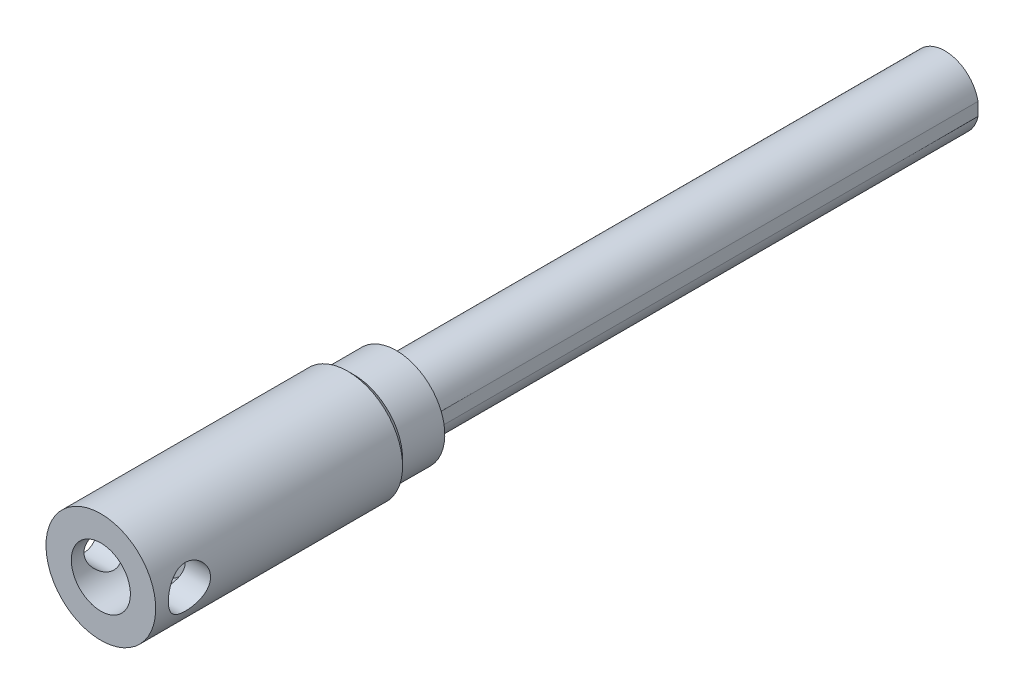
ISO-10303-21;
HEADER;
FILE_DESCRIPTION(('STEP AP214'),'2;1');
FILE_NAME('part.step','',(''),(''),'','','');
FILE_SCHEMA(('AUTOMOTIVE_DESIGN { 1 0 10303 214 1 1 1 1 }'));
ENDSEC;
DATA;
#1=APPLICATION_CONTEXT('core data for automotive mechanical design processes');
#2=APPLICATION_PROTOCOL_DEFINITION('international standard','automotive_design',2000,#1);
#3=PRODUCT_CONTEXT('',#1,'mechanical');
#4=PRODUCT('Part','Part','',(#3));
#5=PRODUCT_RELATED_PRODUCT_CATEGORY('part','',(#4));
#6=PRODUCT_DEFINITION_FORMATION('','',#4);
#7=PRODUCT_DEFINITION_CONTEXT('part definition',#1,'design');
#8=PRODUCT_DEFINITION('design','',#6,#7);
#9=PRODUCT_DEFINITION_SHAPE('','',#8);
#10=(LENGTH_UNIT() NAMED_UNIT(*) SI_UNIT(.MILLI.,.METRE.));
#11=(NAMED_UNIT(*) PLANE_ANGLE_UNIT() SI_UNIT($,.RADIAN.));
#12=(NAMED_UNIT(*) SI_UNIT($,.STERADIAN.) SOLID_ANGLE_UNIT());
#13=UNCERTAINTY_MEASURE_WITH_UNIT(LENGTH_MEASURE(1.E-05),#10,'distance_accuracy_value','');
#14=(GEOMETRIC_REPRESENTATION_CONTEXT(3) GLOBAL_UNCERTAINTY_ASSIGNED_CONTEXT((#13)) GLOBAL_UNIT_ASSIGNED_CONTEXT((#10,
#11,#12)) REPRESENTATION_CONTEXT('',''));
#15=CARTESIAN_POINT('',(0.,0.,0.));
#16=DIRECTION('',(0.,0.,1.));
#17=DIRECTION('',(1.,0.,0.));
#18=AXIS2_PLACEMENT_3D('',#15,#16,#17);
#19=CARTESIAN_POINT('',(-3.46410161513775,0.,182.));
#20=DIRECTION('',(0.866025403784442,-0.5,0.));
#21=DIRECTION('',(0.5,0.866025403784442,0.));
#22=AXIS2_PLACEMENT_3D('',#19,#20,#21);
#23=PLANE('',#22);
#24=DIRECTION('',(0.,0.,1.));
#25=VECTOR('',#24,1.);
#26=CARTESIAN_POINT('',(-1.73205080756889,3.,182.));
#27=LINE('',#26,#25);
#28=CARTESIAN_POINT('',(-1.73205080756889,3.,182.));
#29=VERTEX_POINT('',#28);
#30=CARTESIAN_POINT('',(-1.73205080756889,3.,186.));
#31=VERTEX_POINT('',#30);
#32=EDGE_CURVE('E291',#29,#31,#27,.T.);
#33=ORIENTED_EDGE('',*,*,#32,.T.);
#34=DIRECTION('',(0.5,0.866025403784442,0.));
#35=VECTOR('',#34,1.);
#36=CARTESIAN_POINT('',(-3.46410161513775,0.,186.));
#37=LINE('',#36,#35);
#38=CARTESIAN_POINT('',(-3.46410161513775,0.,186.));
#39=VERTEX_POINT('',#38);
#40=EDGE_CURVE('E29',#39,#31,#37,.T.);
#41=ORIENTED_EDGE('',*,*,#40,.F.);
#42=DIRECTION('',(0.,0.,1.));
#43=VECTOR('',#42,1.);
#44=CARTESIAN_POINT('',(-3.46410161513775,0.,182.));
#45=LINE('',#44,#43);
#46=CARTESIAN_POINT('',(-3.46410161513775,0.,182.));
#47=VERTEX_POINT('',#46);
#48=EDGE_CURVE('E33',#47,#39,#45,.T.);
#49=ORIENTED_EDGE('',*,*,#48,.F.);
#50=DIRECTION('',(0.5,0.866025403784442,0.));
#51=VECTOR('',#50,1.);
#52=CARTESIAN_POINT('',(-3.46410161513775,0.,182.));
#53=LINE('',#52,#51);
#54=EDGE_CURVE('E252',#47,#29,#53,.T.);
#55=ORIENTED_EDGE('',*,*,#54,.T.);
#56=EDGE_LOOP('',(#33,#41,#49,#55));
#57=FACE_BOUND('',#56,.T.);
#58=ADVANCED_FACE('F14',(#57),#23,.T.);
#59=CARTESIAN_POINT('',(1.73205080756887,3.,182.));
#60=DIRECTION('',(0.,1.,0.));
#61=DIRECTION('',(0.,0.,-1.));
#62=AXIS2_PLACEMENT_3D('',#59,#60,#61);
#63=PLANE('',#62);
#64=DIRECTION('',(0.,0.,1.));
#65=VECTOR('',#64,1.);
#66=CARTESIAN_POINT('',(1.73205080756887,3.,182.));
#67=LINE('',#66,#65);
#68=CARTESIAN_POINT('',(1.73205080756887,3.,182.));
#69=VERTEX_POINT('',#68);
#70=CARTESIAN_POINT('',(1.73205080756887,3.,186.));
#71=VERTEX_POINT('',#70);
#72=EDGE_CURVE('E289',#69,#71,#67,.T.);
#73=ORIENTED_EDGE('',*,*,#72,.T.);
#74=DIRECTION('',(-1.,0.,0.));
#75=VECTOR('',#74,1.);
#76=CARTESIAN_POINT('',(1.73205080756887,3.,186.));
#77=LINE('',#76,#75);
#78=EDGE_CURVE('E262',#71,#31,#77,.T.);
#79=ORIENTED_EDGE('',*,*,#78,.T.);
#80=ORIENTED_EDGE('',*,*,#32,.F.);
#81=DIRECTION('',(-1.,0.,0.));
#82=VECTOR('',#81,1.);
#83=CARTESIAN_POINT('',(1.73205080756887,3.,182.));
#84=LINE('',#83,#82);
#85=EDGE_CURVE('E278',#69,#29,#84,.T.);
#86=ORIENTED_EDGE('',*,*,#85,.F.);
#87=EDGE_LOOP('',(#73,#79,#80,#86));
#88=FACE_BOUND('',#87,.T.);
#89=ADVANCED_FACE('F166',(#88),#63,.F.);
#90=CARTESIAN_POINT('',(3.46410161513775,0.,182.));
#91=DIRECTION('',(0.866025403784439,0.5,0.));
#92=DIRECTION('',(-0.5,0.866025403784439,0.));
#93=AXIS2_PLACEMENT_3D('',#90,#91,#92);
#94=PLANE('',#93);
#95=DIRECTION('',(0.,0.,1.));
#96=VECTOR('',#95,1.);
#97=CARTESIAN_POINT('',(3.46410161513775,0.,182.));
#98=LINE('',#97,#96);
#99=CARTESIAN_POINT('',(3.46410161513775,0.,182.));
#100=VERTEX_POINT('',#99);
#101=CARTESIAN_POINT('',(3.46410161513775,0.,186.));
#102=VERTEX_POINT('',#101);
#103=EDGE_CURVE('E287',#100,#102,#98,.T.);
#104=ORIENTED_EDGE('',*,*,#103,.T.);
#105=DIRECTION('',(-0.5,0.866025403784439,0.));
#106=VECTOR('',#105,1.);
#107=CARTESIAN_POINT('',(3.46410161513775,0.,186.));
#108=LINE('',#107,#106);
#109=EDGE_CURVE('E259',#102,#71,#108,.T.);
#110=ORIENTED_EDGE('',*,*,#109,.T.);
#111=ORIENTED_EDGE('',*,*,#72,.F.);
#112=DIRECTION('',(-0.5,0.866025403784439,0.));
#113=VECTOR('',#112,1.);
#114=CARTESIAN_POINT('',(3.46410161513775,0.,182.));
#115=LINE('',#114,#113);
#116=EDGE_CURVE('E275',#100,#69,#115,.T.);
#117=ORIENTED_EDGE('',*,*,#116,.F.);
#118=EDGE_LOOP('',(#104,#110,#111,#117));
#119=FACE_BOUND('',#118,.T.);
#120=ADVANCED_FACE('F171',(#119),#94,.F.);
#121=CARTESIAN_POINT('',(3.46410161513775,0.,182.));
#122=DIRECTION('',(-0.866025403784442,0.5,0.));
#123=DIRECTION('',(-0.5,-0.866025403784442,0.));
#124=AXIS2_PLACEMENT_3D('',#121,#122,#123);
#125=PLANE('',#124);
#126=DIRECTION('',(0.,0.,1.));
#127=VECTOR('',#126,1.);
#128=CARTESIAN_POINT('',(1.73205080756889,-3.,182.));
#129=LINE('',#128,#127);
#130=CARTESIAN_POINT('',(1.73205080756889,-3.,182.));
#131=VERTEX_POINT('',#130);
#132=CARTESIAN_POINT('',(1.73205080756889,-3.,186.));
#133=VERTEX_POINT('',#132);
#134=EDGE_CURVE('E285',#131,#133,#129,.T.);
#135=ORIENTED_EDGE('',*,*,#134,.T.);
#136=DIRECTION('',(-0.5,-0.866025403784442,0.));
#137=VECTOR('',#136,1.);
#138=CARTESIAN_POINT('',(3.46410161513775,0.,186.));
#139=LINE('',#138,#137);
#140=EDGE_CURVE('E256',#102,#133,#139,.T.);
#141=ORIENTED_EDGE('',*,*,#140,.F.);
#142=ORIENTED_EDGE('',*,*,#103,.F.);
#143=DIRECTION('',(-0.5,-0.866025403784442,0.));
#144=VECTOR('',#143,1.);
#145=CARTESIAN_POINT('',(3.46410161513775,0.,182.));
#146=LINE('',#145,#144);
#147=EDGE_CURVE('E272',#100,#131,#146,.T.);
#148=ORIENTED_EDGE('',*,*,#147,.T.);
#149=EDGE_LOOP('',(#135,#141,#142,#148));
#150=FACE_BOUND('',#149,.T.);
#151=ADVANCED_FACE('F184',(#150),#125,.T.);
#152=CARTESIAN_POINT('',(-1.73205080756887,-3.,182.));
#153=DIRECTION('',(0.,-1.,0.));
#154=DIRECTION('',(1.,0.,0.));
#155=AXIS2_PLACEMENT_3D('',#152,#153,#154);
#156=PLANE('',#155);
#157=DIRECTION('',(0.,0.,1.));
#158=VECTOR('',#157,1.);
#159=CARTESIAN_POINT('',(-1.73205080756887,-3.,182.));
#160=LINE('',#159,#158);
#161=CARTESIAN_POINT('',(-1.73205080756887,-3.,182.));
#162=VERTEX_POINT('',#161);
#163=CARTESIAN_POINT('',(-1.73205080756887,-3.,186.));
#164=VERTEX_POINT('',#163);
#165=EDGE_CURVE('E283',#162,#164,#160,.T.);
#166=ORIENTED_EDGE('',*,*,#165,.T.);
#167=DIRECTION('',(1.,0.,0.));
#168=VECTOR('',#167,1.);
#169=CARTESIAN_POINT('',(-1.73205080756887,-3.,186.));
#170=LINE('',#169,#168);
#171=EDGE_CURVE('E253',#164,#133,#170,.T.);
#172=ORIENTED_EDGE('',*,*,#171,.T.);
#173=ORIENTED_EDGE('',*,*,#134,.F.);
#174=DIRECTION('',(1.,0.,0.));
#175=VECTOR('',#174,1.);
#176=CARTESIAN_POINT('',(-1.73205080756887,-3.,182.));
#177=LINE('',#176,#175);
#178=EDGE_CURVE('E269',#162,#131,#177,.T.);
#179=ORIENTED_EDGE('',*,*,#178,.F.);
#180=EDGE_LOOP('',(#166,#172,#173,#179));
#181=FACE_BOUND('',#180,.T.);
#182=ADVANCED_FACE('F180',(#181),#156,.F.);
#183=CARTESIAN_POINT('',(-3.46410161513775,0.,182.));
#184=DIRECTION('',(-0.866025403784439,-0.5,0.));
#185=DIRECTION('',(0.5,-0.866025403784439,0.));
#186=AXIS2_PLACEMENT_3D('',#183,#184,#185);
#187=PLANE('',#186);
#188=DIRECTION('',(0.5,-0.866025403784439,0.));
#189=VECTOR('',#188,1.);
#190=CARTESIAN_POINT('',(-3.46410161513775,0.,182.));
#191=LINE('',#190,#189);
#192=EDGE_CURVE('E266',#47,#162,#191,.T.);
#193=ORIENTED_EDGE('',*,*,#192,.F.);
#194=ORIENTED_EDGE('',*,*,#48,.T.);
#195=DIRECTION('',(0.5,-0.866025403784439,0.));
#196=VECTOR('',#195,1.);
#197=CARTESIAN_POINT('',(-3.46410161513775,0.,186.));
#198=LINE('',#197,#196);
#199=EDGE_CURVE('E249',#39,#164,#198,.T.);
#200=ORIENTED_EDGE('',*,*,#199,.T.);
#201=ORIENTED_EDGE('',*,*,#165,.F.);
#202=EDGE_LOOP('',(#193,#194,#200,#201));
#203=FACE_BOUND('',#202,.T.);
#204=ADVANCED_FACE('F177',(#203),#187,.F.);
#205=CARTESIAN_POINT('',(-5.19615242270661,-3.,182.));
#206=DIRECTION('',(0.,0.,-1.));
#207=DIRECTION('',(0.,-1.,0.));
#208=AXIS2_PLACEMENT_3D('',#205,#206,#207);
#209=PLANE('',#208);
#210=ORIENTED_EDGE('',*,*,#54,.F.);
#211=ORIENTED_EDGE('',*,*,#192,.T.);
#212=ORIENTED_EDGE('',*,*,#178,.T.);
#213=ORIENTED_EDGE('',*,*,#147,.F.);
#214=ORIENTED_EDGE('',*,*,#116,.T.);
#215=ORIENTED_EDGE('',*,*,#85,.T.);
#216=EDGE_LOOP('',(#210,#211,#212,#213,#214,#215));
#217=FACE_BOUND('',#216,.T.);
#218=ADVANCED_FACE('F176',(#217),#209,.F.);
#219=CARTESIAN_POINT('',(0.,0.,186.));
#220=DIRECTION('',(0.,0.,1.));
#221=DIRECTION('',(0.,1.,0.));
#222=AXIS2_PLACEMENT_3D('',#219,#220,#221);
#223=PLANE('',#222);
#224=CARTESIAN_POINT('',(0.,0.,186.));
#225=DIRECTION('',(0.,0.,1.));
#226=DIRECTION('',(0.,1.,0.));
#227=AXIS2_PLACEMENT_3D('',#224,#225,#226);
#228=CIRCLE('',#227,6.5);
#229=CARTESIAN_POINT('',(0.,6.5,186.));
#230=VERTEX_POINT('',#229);
#231=EDGE_CURVE('E9',#230,#230,#228,.T.);
#232=ORIENTED_EDGE('',*,*,#231,.T.);
#233=EDGE_LOOP('',(#232));
#234=FACE_BOUND('',#233,.T.);
#235=ORIENTED_EDGE('',*,*,#199,.F.);
#236=ORIENTED_EDGE('',*,*,#40,.T.);
#237=ORIENTED_EDGE('',*,*,#78,.F.);
#238=ORIENTED_EDGE('',*,*,#109,.F.);
#239=ORIENTED_EDGE('',*,*,#140,.T.);
#240=ORIENTED_EDGE('',*,*,#171,.F.);
#241=EDGE_LOOP('',(#235,#236,#237,#238,#239,#240));
#242=FACE_BOUND('',#241,.T.);
#243=ADVANCED_FACE('F16',(#234,#242),#223,.T.);
#244=CARTESIAN_POINT('',(0.,0.,158.));
#245=DIRECTION('',(0.,0.,1.));
#246=DIRECTION('',(0.,1.,0.));
#247=AXIS2_PLACEMENT_3D('',#244,#245,#246);
#248=CYLINDRICAL_SURFACE('',#247,6.5);
#249=CARTESIAN_POINT('',(0.,0.,178.));
#250=DIRECTION('',(0.,0.,1.));
#251=DIRECTION('',(0.,1.,0.));
#252=AXIS2_PLACEMENT_3D('',#249,#250,#251);
#253=CIRCLE('',#252,6.5);
#254=CARTESIAN_POINT('',(0.,6.5,178.));
#255=VERTEX_POINT('',#254);
#256=EDGE_CURVE('E22',#255,#255,#253,.T.);
#257=ORIENTED_EDGE('',*,*,#256,.T.);
#258=EDGE_LOOP('',(#257));
#259=FACE_BOUND('',#258,.T.);
#260=ORIENTED_EDGE('',*,*,#231,.F.);
#261=EDGE_LOOP('',(#260));
#262=FACE_BOUND('',#261,.T.);
#263=ADVANCED_FACE('F191',(#259,#262),#248,.T.);
#264=CARTESIAN_POINT('',(0.,0.,0.));
#265=DIRECTION('',(0.,0.,1.));
#266=DIRECTION('',(-1.,0.,0.));
#267=AXIS2_PLACEMENT_3D('',#264,#265,#266);
#268=PLANE('',#267);
#269=DIRECTION('',(0.,-1.,0.));
#270=VECTOR('',#269,1.);
#271=CARTESIAN_POINT('',(7.85,-1.54191439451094,0.));
#272=LINE('',#271,#270);
#273=CARTESIAN_POINT('',(7.85,1.54191439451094,0.));
#274=VERTEX_POINT('',#273);
#275=CARTESIAN_POINT('',(7.85,-1.54191439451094,0.));
#276=VERTEX_POINT('',#275);
#277=EDGE_CURVE('E91',#274,#276,#272,.T.);
#278=ORIENTED_EDGE('',*,*,#277,.T.);
#279=CARTESIAN_POINT('',(0.,0.,0.));
#280=DIRECTION('',(0.,0.,1.));
#281=DIRECTION('',(-1.,0.,0.));
#282=AXIS2_PLACEMENT_3D('',#279,#280,#281);
#283=CIRCLE('',#282,8.);
#284=EDGE_CURVE('E83',#274,#276,#283,.T.);
#285=ORIENTED_EDGE('',*,*,#284,.F.);
#286=EDGE_LOOP('',(#278,#285));
#287=FACE_BOUND('',#286,.T.);
#288=ADVANCED_FACE('F95',(#287),#268,.F.);
#289=CARTESIAN_POINT('',(7.85,-1.54191439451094,150.));
#290=DIRECTION('',(1.,0.,0.));
#291=DIRECTION('',(0.,0.,1.));
#292=AXIS2_PLACEMENT_3D('',#289,#290,#291);
#293=PLANE('',#292);
#294=DIRECTION('',(0.,1.,0.));
#295=VECTOR('',#294,1.);
#296=CARTESIAN_POINT('',(7.85,11.5,130.));
#297=LINE('',#296,#295);
#298=CARTESIAN_POINT('',(7.85,-1.54191439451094,130.));
#299=VERTEX_POINT('',#298);
#300=CARTESIAN_POINT('',(7.85,1.54191439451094,130.));
#301=VERTEX_POINT('',#300);
#302=EDGE_CURVE('E246',#299,#301,#297,.T.);
#303=ORIENTED_EDGE('',*,*,#302,.F.);
#304=DIRECTION('',(0.,0.,-1.));
#305=VECTOR('',#304,1.);
#306=CARTESIAN_POINT('',(7.85,-1.54191439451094,150.));
#307=LINE('',#306,#305);
#308=EDGE_CURVE('E88',#299,#276,#307,.T.);
#309=ORIENTED_EDGE('',*,*,#308,.T.);
#310=ORIENTED_EDGE('',*,*,#277,.F.);
#311=DIRECTION('',(0.,0.,-1.));
#312=VECTOR('',#311,1.);
#313=CARTESIAN_POINT('',(7.85,1.54191439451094,150.));
#314=LINE('',#313,#312);
#315=EDGE_CURVE('E78',#301,#274,#314,.T.);
#316=ORIENTED_EDGE('',*,*,#315,.F.);
#317=EDGE_LOOP('',(#303,#309,#310,#316));
#318=FACE_BOUND('',#317,.T.);
#319=ADVANCED_FACE('F92',(#318),#293,.T.);
#320=CARTESIAN_POINT('',(0.,0.,150.));
#321=DIRECTION('',(0.,0.,-1.));
#322=DIRECTION('',(1.,0.,0.));
#323=AXIS2_PLACEMENT_3D('',#320,#321,#322);
#324=CYLINDRICAL_SURFACE('',#323,8.);
#325=ORIENTED_EDGE('',*,*,#308,.F.);
#326=CARTESIAN_POINT('',(0.,0.,130.));
#327=DIRECTION('',(0.,0.,1.));
#328=DIRECTION('',(1.02551700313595E-09,-1.,0.));
#329=AXIS2_PLACEMENT_3D('',#326,#327,#328);
#330=CIRCLE('',#329,8.);
#331=EDGE_CURVE('E84',#299,#301,#330,.F.);
#332=ORIENTED_EDGE('',*,*,#331,.T.);
#333=ORIENTED_EDGE('',*,*,#315,.T.);
#334=ORIENTED_EDGE('',*,*,#284,.T.);
#335=EDGE_LOOP('',(#325,#332,#333,#334));
#336=FACE_BOUND('',#335,.T.);
#337=ADVANCED_FACE('F81',(#336),#324,.T.);
#338=CARTESIAN_POINT('',(0.,11.5,130.));
#339=DIRECTION('',(0.,0.,1.));
#340=DIRECTION('',(0.,-1.,0.));
#341=AXIS2_PLACEMENT_3D('',#338,#339,#340);
#342=PLANE('',#341);
#343=CARTESIAN_POINT('',(0.,0.,130.));
#344=DIRECTION('',(0.,0.,-1.));
#345=DIRECTION('',(0.,1.,0.));
#346=AXIS2_PLACEMENT_3D('',#343,#344,#345);
#347=CIRCLE('',#346,11.5);
#348=CARTESIAN_POINT('',(0.,11.5,130.));
#349=VERTEX_POINT('',#348);
#350=EDGE_CURVE('E222',#349,#349,#347,.T.);
#351=ORIENTED_EDGE('',*,*,#350,.T.);
#352=EDGE_LOOP('',(#351));
#353=FACE_BOUND('',#352,.T.);
#354=ORIENTED_EDGE('',*,*,#331,.F.);
#355=ORIENTED_EDGE('',*,*,#302,.T.);
#356=EDGE_LOOP('',(#354,#355));
#357=FACE_BOUND('',#356,.T.);
#358=ADVANCED_FACE('F126',(#353,#357),#342,.F.);
#359=CARTESIAN_POINT('',(0.,0.,130.));
#360=DIRECTION('',(0.,0.,-1.));
#361=DIRECTION('',(0.,1.,0.));
#362=AXIS2_PLACEMENT_3D('',#359,#360,#361);
#363=CYLINDRICAL_SURFACE('',#362,11.5);
#364=ORIENTED_EDGE('',*,*,#350,.F.);
#365=EDGE_LOOP('',(#364));
#366=FACE_BOUND('',#365,.T.);
#367=CARTESIAN_POINT('',(0.,0.,140.));
#368=DIRECTION('',(0.,0.,-1.));
#369=DIRECTION('',(0.,1.,0.));
#370=AXIS2_PLACEMENT_3D('',#367,#368,#369);
#371=CIRCLE('',#370,11.5);
#372=CARTESIAN_POINT('',(0.,11.5,140.));
#373=VERTEX_POINT('',#372);
#374=EDGE_CURVE('E220',#373,#373,#371,.T.);
#375=ORIENTED_EDGE('',*,*,#374,.T.);
#376=EDGE_LOOP('',(#375));
#377=FACE_BOUND('',#376,.T.);
#378=ADVANCED_FACE('F151',(#366,#377),#363,.T.);
#379=CARTESIAN_POINT('',(0.,0.,140.));
#380=DIRECTION('',(0.,0.,1.));
#381=DIRECTION('',(0.,-1.,0.));
#382=AXIS2_PLACEMENT_3D('',#379,#380,#381);
#383=CONICAL_SURFACE('',#382,11.5,0.785398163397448);
#384=CARTESIAN_POINT('',(0.,0.,141.5));
#385=DIRECTION('',(0.,0.,1.));
#386=DIRECTION('',(0.,-1.,0.));
#387=AXIS2_PLACEMENT_3D('',#384,#385,#386);
#388=CIRCLE('',#387,13.);
#389=CARTESIAN_POINT('',(0.,-13.,141.5));
#390=VERTEX_POINT('',#389);
#391=EDGE_CURVE('E145',#390,#390,#388,.T.);
#392=ORIENTED_EDGE('',*,*,#391,.F.);
#393=EDGE_LOOP('',(#392));
#394=FACE_BOUND('',#393,.T.);
#395=ORIENTED_EDGE('',*,*,#374,.F.);
#396=EDGE_LOOP('',(#395));
#397=FACE_BOUND('',#396,.T.);
#398=ADVANCED_FACE('F124',(#394,#397),#383,.T.);
#399=CARTESIAN_POINT('',(0.,0.,130.));
#400=DIRECTION('',(0.,0.,-1.));
#401=DIRECTION('',(0.,1.,0.));
#402=AXIS2_PLACEMENT_3D('',#399,#400,#401);
#403=CYLINDRICAL_SURFACE('',#402,13.);
#404=ORIENTED_EDGE('',*,*,#391,.T.);
#405=EDGE_LOOP('',(#404));
#406=FACE_BOUND('',#405,.T.);
#407=CARTESIAN_POINT('',(-13.,0.,197.));
#408=CARTESIAN_POINT('',(-13.0000005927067,-0.135105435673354,197.000000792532));
#409=CARTESIAN_POINT('',(-12.9978893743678,-0.270200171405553,196.994519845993));
#410=CARTESIAN_POINT('',(-12.9895020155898,-0.539422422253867,196.972651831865));
#411=CARTESIAN_POINT('',(-12.9832245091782,-0.673549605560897,196.956261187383));
#412=CARTESIAN_POINT('',(-12.9666767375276,-0.939715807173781,196.912749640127));
#413=CARTESIAN_POINT('',(-12.9564088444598,-1.07175601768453,196.885635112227));
#414=CARTESIAN_POINT('',(-12.9321488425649,-1.33294373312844,196.820930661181));
#415=CARTESIAN_POINT('',(-12.9181552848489,-1.46209009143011,196.783336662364));
#416=CARTESIAN_POINT('',(-12.8868451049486,-1.71626719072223,196.698121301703));
#417=CARTESIAN_POINT('',(-12.8695366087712,-1.84130713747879,196.650524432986));
#418=CARTESIAN_POINT('',(-12.832015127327,-2.08682707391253,196.545657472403));
#419=CARTESIAN_POINT('',(-12.8118010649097,-2.2073053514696,196.488383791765));
#420=CARTESIAN_POINT('',(-12.7475355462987,-2.56075981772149,196.302698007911));
#421=CARTESIAN_POINT('',(-12.6998359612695,-2.78594772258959,196.160356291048));
#422=CARTESIAN_POINT('',(-12.5973130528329,-3.21857896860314,195.836254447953));
#423=CARTESIAN_POINT('',(-12.5422812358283,-3.42495370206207,195.653146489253));
#424=CARTESIAN_POINT('',(-12.432249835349,-3.80503922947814,195.255341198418));
#425=CARTESIAN_POINT('',(-12.3772502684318,-3.97873925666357,195.04063349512));
#426=CARTESIAN_POINT('',(-12.2981799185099,-4.21450431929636,194.694180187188));
#427=CARTESIAN_POINT('',(-12.2719168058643,-4.29018004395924,194.57197767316));
#428=CARTESIAN_POINT('',(-12.221810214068,-4.43090570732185,194.321146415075));
#429=CARTESIAN_POINT('',(-12.1979657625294,-4.49595992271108,194.192520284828));
#430=CARTESIAN_POINT('',(-12.1534684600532,-4.61489357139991,193.929657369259));
#431=CARTESIAN_POINT('',(-12.1328159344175,-4.66877186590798,193.795420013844));
#432=CARTESIAN_POINT('',(-12.095423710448,-4.7648066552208,193.522349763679));
#433=CARTESIAN_POINT('',(-12.0786820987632,-4.80696888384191,193.383519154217));
#434=CARTESIAN_POINT('',(-12.0503198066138,-4.87762040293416,193.108220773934));
#435=CARTESIAN_POINT('',(-12.0385125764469,-4.90661231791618,192.971901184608));
#436=CARTESIAN_POINT('',(-12.0194473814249,-4.95313223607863,192.697061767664));
#437=CARTESIAN_POINT('',(-12.0121874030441,-4.9706653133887,192.558542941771));
#438=CARTESIAN_POINT('',(-12.0024704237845,-4.99408302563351,192.280379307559));
#439=CARTESIAN_POINT('',(-12.0000125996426,-4.99996965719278,192.140734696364));
#440=CARTESIAN_POINT('',(-11.9999874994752,-5.00003010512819,191.861445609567));
#441=CARTESIAN_POINT('',(-12.0024200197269,-4.99420440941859,191.721801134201));
#442=CARTESIAN_POINT('',(-12.0117767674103,-4.97165500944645,191.452532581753));
#443=CARTESIAN_POINT('',(-12.0184047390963,-4.95564978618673,191.322837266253));
#444=CARTESIAN_POINT('',(-12.0356604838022,-4.91359264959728,191.06531480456));
#445=CARTESIAN_POINT('',(-12.0462895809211,-4.88753741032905,190.937488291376));
#446=CARTESIAN_POINT('',(-12.0712213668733,-4.82563229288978,190.684627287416));
#447=CARTESIAN_POINT('',(-12.0855231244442,-4.78978489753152,190.559592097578));
#448=CARTESIAN_POINT('',(-12.1173774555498,-4.70861515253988,190.313045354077));
#449=CARTESIAN_POINT('',(-12.1349312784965,-4.66328916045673,190.191535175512));
#450=CARTESIAN_POINT('',(-12.1924755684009,-4.51169850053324,189.828828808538));
#451=CARTESIAN_POINT('',(-12.2368566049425,-4.3909811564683,189.594180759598));
#452=CARTESIAN_POINT('',(-12.3323705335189,-4.11508008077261,189.14778516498));
#453=CARTESIAN_POINT('',(-12.3835058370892,-3.95988402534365,188.936045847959));
#454=CARTESIAN_POINT('',(-12.4912059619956,-3.60641390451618,188.525493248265));
#455=CARTESIAN_POINT('',(-12.547898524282,-3.4058638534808,188.32866466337));
#456=CARTESIAN_POINT('',(-12.6572139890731,-2.97397181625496,187.970835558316));
#457=CARTESIAN_POINT('',(-12.7098361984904,-2.74262460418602,187.809841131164));
#458=CARTESIAN_POINT('',(-12.8062280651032,-2.25041847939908,187.525890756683));
#459=CARTESIAN_POINT('',(-12.849831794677,-1.98912426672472,187.403628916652));
#460=CARTESIAN_POINT('',(-12.9220340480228,-1.44757926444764,187.205467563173));
#461=CARTESIAN_POINT('',(-12.9506395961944,-1.16733741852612,187.12954634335));
#462=CARTESIAN_POINT('',(-12.9883704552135,-0.612551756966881,187.030115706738));
#463=CARTESIAN_POINT('',(-12.9984884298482,-0.338554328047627,187.003932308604));
#464=CARTESIAN_POINT('',(-13.0011941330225,0.210076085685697,186.996893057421));
#465=CARTESIAN_POINT('',(-12.9937859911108,0.484708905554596,187.016026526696));
#466=CARTESIAN_POINT('',(-12.9629250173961,1.01504689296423,187.097070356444));
#467=CARTESIAN_POINT('',(-12.9401399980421,1.27106696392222,187.157201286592));
#468=CARTESIAN_POINT('',(-12.8814960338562,1.76918181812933,187.316157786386));
#469=CARTESIAN_POINT('',(-12.8456353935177,2.01127479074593,187.414988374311));
#470=CARTESIAN_POINT('',(-12.7630227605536,2.4827968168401,187.651737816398));
#471=CARTESIAN_POINT('',(-12.7159770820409,2.71163049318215,187.790737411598));
#472=CARTESIAN_POINT('',(-12.6161681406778,3.14348850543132,188.102624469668));
#473=CARTESIAN_POINT('',(-12.5634026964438,3.34650292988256,188.275524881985));
#474=CARTESIAN_POINT('',(-12.4539121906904,3.73404077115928,188.662878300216));
#475=CARTESIAN_POINT('',(-12.3971420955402,3.91667798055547,188.879223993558));
#476=CARTESIAN_POINT('',(-12.3161782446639,4.16163312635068,189.224959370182));
#477=CARTESIAN_POINT('',(-12.289873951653,4.23848974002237,189.343820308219));
#478=CARTESIAN_POINT('',(-12.2394322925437,4.3820169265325,189.587958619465));
#479=CARTESIAN_POINT('',(-12.2152940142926,4.44869179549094,189.713233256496));
#480=CARTESIAN_POINT('',(-12.1697850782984,4.57172493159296,189.97027707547));
#481=CARTESIAN_POINT('',(-12.1484337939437,4.62801200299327,190.102083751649));
#482=CARTESIAN_POINT('',(-12.1094072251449,4.72918571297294,190.370473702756));
#483=CARTESIAN_POINT('',(-12.091730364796,4.77407724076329,190.50705490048));
#484=CARTESIAN_POINT('',(-12.060669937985,4.85201021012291,190.783989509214));
#485=CARTESIAN_POINT('',(-12.0472849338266,4.88505562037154,190.924341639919));
#486=CARTESIAN_POINT('',(-12.0252955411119,4.93893894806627,191.207736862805));
#487=CARTESIAN_POINT('',(-12.0166907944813,4.95977777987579,191.3507797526));
#488=CARTESIAN_POINT('',(-12.0049970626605,4.98801162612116,191.628641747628));
#489=CARTESIAN_POINT('',(-12.0015752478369,4.99621847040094,191.763364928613));
#490=CARTESIAN_POINT('',(-11.9992876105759,5.0017104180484,192.033121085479));
#491=CARTESIAN_POINT('',(-12.0004233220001,4.99899184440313,192.16815415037));
#492=CARTESIAN_POINT('',(-12.0072143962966,4.98265787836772,192.437377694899));
#493=CARTESIAN_POINT('',(-12.0128675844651,4.96904772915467,192.571568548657));
#494=CARTESIAN_POINT('',(-12.0285026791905,4.93107933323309,192.838213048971));
#495=CARTESIAN_POINT('',(-12.0384862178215,4.90671703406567,192.970666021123));
#496=CARTESIAN_POINT('',(-12.0620452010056,4.84850652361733,193.228341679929));
#497=CARTESIAN_POINT('',(-12.0754859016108,4.81501180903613,193.353656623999));
#498=CARTESIAN_POINT('',(-12.1057001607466,4.73853416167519,193.600960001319));
#499=CARTESIAN_POINT('',(-12.1224749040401,4.69554785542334,193.722947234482));
#500=CARTESIAN_POINT('',(-12.1771051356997,4.55286045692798,194.082766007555));
#501=CARTESIAN_POINT('',(-12.2192851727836,4.43938737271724,194.314645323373));
#502=CARTESIAN_POINT('',(-12.3132307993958,4.17198360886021,194.769103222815));
#503=CARTESIAN_POINT('',(-12.3653926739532,4.01618977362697,194.990492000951));
#504=CARTESIAN_POINT('',(-12.4721601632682,3.67120048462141,195.405133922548));
#505=CARTESIAN_POINT('',(-12.5267665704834,3.48199413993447,195.598377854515));
#506=CARTESIAN_POINT('',(-12.6079253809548,3.17059659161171,195.8688191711));
#507=CARTESIAN_POINT('',(-12.6355919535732,3.05874516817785,195.957846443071));
#508=CARTESIAN_POINT('',(-12.6893179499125,2.82758971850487,196.126153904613));
#509=CARTESIAN_POINT('',(-12.7153779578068,2.70828843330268,196.205437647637));
#510=CARTESIAN_POINT('',(-12.7651818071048,2.46288880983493,196.353705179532));
#511=CARTESIAN_POINT('',(-12.788924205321,2.33678631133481,196.42268256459));
#512=CARTESIAN_POINT('',(-12.833394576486,2.0787295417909,196.549676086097));
#513=CARTESIAN_POINT('',(-12.8541238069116,1.94677774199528,196.607696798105));
#514=CARTESIAN_POINT('',(-12.8932221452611,1.66905616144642,196.715705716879));
#515=CARTESIAN_POINT('',(-12.9113467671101,1.52294807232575,196.764915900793));
#516=CARTESIAN_POINT('',(-12.9428888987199,1.22632421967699,196.849734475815));
#517=CARTESIAN_POINT('',(-12.956306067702,1.07580813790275,196.885341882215));
#518=CARTESIAN_POINT('',(-12.9779612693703,0.771832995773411,196.942487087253));
#519=CARTESIAN_POINT('',(-12.9862017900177,0.618375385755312,196.964031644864));
#520=CARTESIAN_POINT('',(-12.9972204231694,0.309940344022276,196.992786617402));
#521=CARTESIAN_POINT('',(-12.9999993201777,0.154963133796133,196.999999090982));
#522=CARTESIAN_POINT('',(-13.,0.,197.));
#523=B_SPLINE_CURVE_WITH_KNOTS('',3,(#407,#408,#409,#410,#411,#412,#413,#414,#415,#416,#417,
#418,#419,#420,#421,#422,#423,#424,#425,#426,#427,#428,#429,#430,#431,#432,#433,#434,#435,#436,
#437,#438,#439,#440,#441,#442,#443,#444,#445,#446,#447,#448,#449,#450,#451,#452,#453,#454,#455,
#456,#457,#458,#459,#460,#461,#462,#463,#464,#465,#466,#467,#468,#469,#470,#471,#472,#473,#474,
#475,#476,#477,#478,#479,#480,#481,#482,#483,#484,#485,#486,#487,#488,#489,#490,#491,#492,#493,
#494,#495,#496,#497,#498,#499,#500,#501,#502,#503,#504,#505,#506,#507,#508,#509,#510,#511,#512,
#513,#514,#515,#516,#517,#518,#519,#520,#521,#522),.UNSPECIFIED.,.T.,.F.,(4,2,2,2,2,2,2,2,2,2,2,
2,2,2,2,2,2,2,2,2,2,2,2,2,2,2,2,2,2,2,2,2,2,2,2,2,2,2,2,2,2,2,2,2,2,2,2,2,2,2,2,2,2,2,2,2,2,4),
(0.,0.405170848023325,0.810474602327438,1.21553778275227,1.62075872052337,2.02499875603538,
2.42938903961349,3.23756407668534,4.07803275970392,4.91877790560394,5.35667473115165,
5.79439480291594,6.23215945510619,6.66970948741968,7.08876415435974,7.5076331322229,
7.92643029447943,8.34521001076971,8.73729047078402,9.12950079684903,9.52161176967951,
9.91387370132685,10.7128942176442,11.5122007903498,12.3682501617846,13.2244449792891,
14.0952133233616,14.9655734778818,15.7876487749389,16.6095303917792,17.3978369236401,
18.1862457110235,18.998236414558,19.8105378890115,20.6724430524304,21.1039269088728,
21.5352281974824,21.96938384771,22.4033529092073,22.8371764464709,23.2709674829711,
23.6755054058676,24.0801794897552,24.4846588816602,24.8892908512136,25.2800632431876,
25.6709747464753,26.4522151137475,27.2759013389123,28.0998565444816,28.5362466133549,
28.9724770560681,29.4089774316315,29.8452951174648,30.3102744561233,30.7752874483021,
31.240076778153,31.704799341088),.UNSPECIFIED.);
#524=CARTESIAN_POINT('',(-13.,0.,197.));
#525=VERTEX_POINT('',#524);
#526=EDGE_CURVE('E139',#525,#525,#523,.T.);
#527=ORIENTED_EDGE('',*,*,#526,.T.);
#528=EDGE_LOOP('',(#527));
#529=FACE_BOUND('',#528,.T.);
#530=CARTESIAN_POINT('',(13.,0.,197.));
#531=CARTESIAN_POINT('',(13.0000005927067,0.135105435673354,197.000000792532));
#532=CARTESIAN_POINT('',(12.9978893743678,0.270200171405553,196.994519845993));
#533=CARTESIAN_POINT('',(12.9895020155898,0.539422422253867,196.972651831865));
#534=CARTESIAN_POINT('',(12.9832245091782,0.673549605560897,196.956261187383));
#535=CARTESIAN_POINT('',(12.9666767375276,0.939715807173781,196.912749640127));
#536=CARTESIAN_POINT('',(12.9564088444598,1.07175601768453,196.885635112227));
#537=CARTESIAN_POINT('',(12.9321488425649,1.33294373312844,196.820930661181));
#538=CARTESIAN_POINT('',(12.9181552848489,1.46209009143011,196.783336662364));
#539=CARTESIAN_POINT('',(12.8868451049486,1.71626719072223,196.698121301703));
#540=CARTESIAN_POINT('',(12.8695366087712,1.84130713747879,196.650524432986));
#541=CARTESIAN_POINT('',(12.832015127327,2.08682707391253,196.545657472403));
#542=CARTESIAN_POINT('',(12.8118010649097,2.2073053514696,196.488383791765));
#543=CARTESIAN_POINT('',(12.7475355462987,2.56075981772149,196.302698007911));
#544=CARTESIAN_POINT('',(12.6998359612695,2.78594772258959,196.160356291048));
#545=CARTESIAN_POINT('',(12.5973130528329,3.21857896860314,195.836254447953));
#546=CARTESIAN_POINT('',(12.5422812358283,3.42495370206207,195.653146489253));
#547=CARTESIAN_POINT('',(12.432249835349,3.80503922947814,195.255341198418));
#548=CARTESIAN_POINT('',(12.3772502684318,3.97873925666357,195.04063349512));
#549=CARTESIAN_POINT('',(12.2981799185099,4.21450431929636,194.694180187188));
#550=CARTESIAN_POINT('',(12.2719168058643,4.29018004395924,194.57197767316));
#551=CARTESIAN_POINT('',(12.221810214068,4.43090570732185,194.321146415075));
#552=CARTESIAN_POINT('',(12.1979657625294,4.49595992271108,194.192520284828));
#553=CARTESIAN_POINT('',(12.1534684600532,4.61489357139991,193.929657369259));
#554=CARTESIAN_POINT('',(12.1328159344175,4.66877186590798,193.795420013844));
#555=CARTESIAN_POINT('',(12.095423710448,4.7648066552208,193.522349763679));
#556=CARTESIAN_POINT('',(12.0786820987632,4.80696888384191,193.383519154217));
#557=CARTESIAN_POINT('',(12.0503198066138,4.87762040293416,193.108220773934));
#558=CARTESIAN_POINT('',(12.0385125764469,4.90661231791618,192.971901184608));
#559=CARTESIAN_POINT('',(12.0194473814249,4.95313223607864,192.697061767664));
#560=CARTESIAN_POINT('',(12.0121874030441,4.97066531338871,192.558542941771));
#561=CARTESIAN_POINT('',(12.0024704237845,4.99408302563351,192.280379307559));
#562=CARTESIAN_POINT('',(12.0000125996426,4.99996965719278,192.140734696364));
#563=CARTESIAN_POINT('',(11.9999874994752,5.00003010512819,191.861445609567));
#564=CARTESIAN_POINT('',(12.0024200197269,4.99420440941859,191.721801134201));
#565=CARTESIAN_POINT('',(12.0117767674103,4.97165500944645,191.452532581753));
#566=CARTESIAN_POINT('',(12.0184047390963,4.95564978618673,191.322837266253));
#567=CARTESIAN_POINT('',(12.0356604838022,4.91359264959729,191.06531480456));
#568=CARTESIAN_POINT('',(12.0462895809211,4.88753741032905,190.937488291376));
#569=CARTESIAN_POINT('',(12.0712213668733,4.82563229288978,190.684627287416));
#570=CARTESIAN_POINT('',(12.0855231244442,4.78978489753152,190.559592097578));
#571=CARTESIAN_POINT('',(12.1173774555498,4.70861515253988,190.313045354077));
#572=CARTESIAN_POINT('',(12.1349312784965,4.66328916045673,190.191535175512));
#573=CARTESIAN_POINT('',(12.1924755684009,4.51169850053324,189.828828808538));
#574=CARTESIAN_POINT('',(12.2368566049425,4.39098115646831,189.594180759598));
#575=CARTESIAN_POINT('',(12.3323705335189,4.11508008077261,189.14778516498));
#576=CARTESIAN_POINT('',(12.3835058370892,3.95988402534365,188.936045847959));
#577=CARTESIAN_POINT('',(12.4912059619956,3.60641390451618,188.525493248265));
#578=CARTESIAN_POINT('',(12.547898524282,3.4058638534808,188.32866466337));
#579=CARTESIAN_POINT('',(12.6572139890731,2.97397181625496,187.970835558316));
#580=CARTESIAN_POINT('',(12.7098361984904,2.74262460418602,187.809841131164));
#581=CARTESIAN_POINT('',(12.8062280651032,2.25041847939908,187.525890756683));
#582=CARTESIAN_POINT('',(12.849831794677,1.98912426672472,187.403628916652));
#583=CARTESIAN_POINT('',(12.9220340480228,1.44757926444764,187.205467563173));
#584=CARTESIAN_POINT('',(12.9506395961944,1.16733741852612,187.12954634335));
#585=CARTESIAN_POINT('',(12.9883704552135,0.612551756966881,187.030115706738));
#586=CARTESIAN_POINT('',(12.9984884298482,0.338554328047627,187.003932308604));
#587=CARTESIAN_POINT('',(13.0011941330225,-0.210076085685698,186.996893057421));
#588=CARTESIAN_POINT('',(12.9937859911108,-0.484708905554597,187.016026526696));
#589=CARTESIAN_POINT('',(12.9629250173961,-1.01504689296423,187.097070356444));
#590=CARTESIAN_POINT('',(12.9401399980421,-1.27106696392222,187.157201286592));
#591=CARTESIAN_POINT('',(12.8814960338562,-1.76918181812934,187.316157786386));
#592=CARTESIAN_POINT('',(12.8456353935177,-2.01127479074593,187.414988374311));
#593=CARTESIAN_POINT('',(12.7630227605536,-2.4827968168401,187.651737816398));
#594=CARTESIAN_POINT('',(12.7159770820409,-2.71163049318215,187.790737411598));
#595=CARTESIAN_POINT('',(12.6161681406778,-3.14348850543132,188.102624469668));
#596=CARTESIAN_POINT('',(12.5634026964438,-3.34650292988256,188.275524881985));
#597=CARTESIAN_POINT('',(12.4539121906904,-3.73404077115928,188.662878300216));
#598=CARTESIAN_POINT('',(12.3971420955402,-3.91667798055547,188.879223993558));
#599=CARTESIAN_POINT('',(12.3161782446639,-4.16163312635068,189.224959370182));
#600=CARTESIAN_POINT('',(12.289873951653,-4.23848974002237,189.343820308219));
#601=CARTESIAN_POINT('',(12.2394322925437,-4.3820169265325,189.587958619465));
#602=CARTESIAN_POINT('',(12.2152940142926,-4.44869179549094,189.713233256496));
#603=CARTESIAN_POINT('',(12.1697850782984,-4.57172493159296,189.97027707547));
#604=CARTESIAN_POINT('',(12.1484337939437,-4.62801200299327,190.102083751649));
#605=CARTESIAN_POINT('',(12.1094072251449,-4.72918571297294,190.370473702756));
#606=CARTESIAN_POINT('',(12.091730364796,-4.77407724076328,190.50705490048));
#607=CARTESIAN_POINT('',(12.060669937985,-4.85201021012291,190.783989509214));
#608=CARTESIAN_POINT('',(12.0472849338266,-4.88505562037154,190.924341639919));
#609=CARTESIAN_POINT('',(12.0252955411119,-4.93893894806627,191.207736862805));
#610=CARTESIAN_POINT('',(12.0166907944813,-4.95977777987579,191.3507797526));
#611=CARTESIAN_POINT('',(12.0049970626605,-4.98801162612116,191.628641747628));
#612=CARTESIAN_POINT('',(12.0015752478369,-4.99621847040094,191.763364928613));
#613=CARTESIAN_POINT('',(11.9992876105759,-5.0017104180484,192.033121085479));
#614=CARTESIAN_POINT('',(12.0004233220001,-4.99899184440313,192.16815415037));
#615=CARTESIAN_POINT('',(12.0072143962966,-4.98265787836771,192.437377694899));
#616=CARTESIAN_POINT('',(12.0128675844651,-4.96904772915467,192.571568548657));
#617=CARTESIAN_POINT('',(12.0285026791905,-4.93107933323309,192.838213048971));
#618=CARTESIAN_POINT('',(12.0384862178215,-4.90671703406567,192.970666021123));
#619=CARTESIAN_POINT('',(12.0620452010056,-4.84850652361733,193.228341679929));
#620=CARTESIAN_POINT('',(12.0754859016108,-4.81501180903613,193.353656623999));
#621=CARTESIAN_POINT('',(12.1057001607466,-4.73853416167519,193.600960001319));
#622=CARTESIAN_POINT('',(12.1224749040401,-4.69554785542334,193.722947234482));
#623=CARTESIAN_POINT('',(12.1771051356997,-4.55286045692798,194.082766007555));
#624=CARTESIAN_POINT('',(12.2192851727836,-4.43938737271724,194.314645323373));
#625=CARTESIAN_POINT('',(12.3132307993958,-4.17198360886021,194.769103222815));
#626=CARTESIAN_POINT('',(12.3653926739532,-4.01618977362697,194.990492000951));
#627=CARTESIAN_POINT('',(12.4721601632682,-3.67120048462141,195.405133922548));
#628=CARTESIAN_POINT('',(12.5267665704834,-3.48199413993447,195.598377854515));
#629=CARTESIAN_POINT('',(12.6079253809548,-3.17059659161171,195.8688191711));
#630=CARTESIAN_POINT('',(12.6355919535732,-3.05874516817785,195.957846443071));
#631=CARTESIAN_POINT('',(12.6893179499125,-2.82758971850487,196.126153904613));
#632=CARTESIAN_POINT('',(12.7153779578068,-2.70828843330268,196.205437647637));
#633=CARTESIAN_POINT('',(12.7651818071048,-2.46288880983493,196.353705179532));
#634=CARTESIAN_POINT('',(12.788924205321,-2.33678631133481,196.42268256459));
#635=CARTESIAN_POINT('',(12.833394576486,-2.0787295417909,196.549676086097));
#636=CARTESIAN_POINT('',(12.8541238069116,-1.94677774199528,196.607696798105));
#637=CARTESIAN_POINT('',(12.8932221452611,-1.66905616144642,196.715705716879));
#638=CARTESIAN_POINT('',(12.9113467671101,-1.52294807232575,196.764915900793));
#639=CARTESIAN_POINT('',(12.9428888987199,-1.22632421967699,196.849734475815));
#640=CARTESIAN_POINT('',(12.956306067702,-1.07580813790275,196.885341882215));
#641=CARTESIAN_POINT('',(12.9779612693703,-0.771832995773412,196.942487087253));
#642=CARTESIAN_POINT('',(12.9862017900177,-0.618375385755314,196.964031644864));
#643=CARTESIAN_POINT('',(12.9972204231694,-0.309940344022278,196.992786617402));
#644=CARTESIAN_POINT('',(12.9999993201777,-0.154963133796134,196.999999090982));
#645=CARTESIAN_POINT('',(13.,0.,197.));
#646=B_SPLINE_CURVE_WITH_KNOTS('',3,(#530,#531,#532,#533,#534,#535,#536,#537,#538,#539,#540,
#541,#542,#543,#544,#545,#546,#547,#548,#549,#550,#551,#552,#553,#554,#555,#556,#557,#558,#559,
#560,#561,#562,#563,#564,#565,#566,#567,#568,#569,#570,#571,#572,#573,#574,#575,#576,#577,#578,
#579,#580,#581,#582,#583,#584,#585,#586,#587,#588,#589,#590,#591,#592,#593,#594,#595,#596,#597,
#598,#599,#600,#601,#602,#603,#604,#605,#606,#607,#608,#609,#610,#611,#612,#613,#614,#615,#616,
#617,#618,#619,#620,#621,#622,#623,#624,#625,#626,#627,#628,#629,#630,#631,#632,#633,#634,#635,
#636,#637,#638,#639,#640,#641,#642,#643,#644,#645),.UNSPECIFIED.,.T.,.F.,(4,2,2,2,2,2,2,2,2,2,2,
2,2,2,2,2,2,2,2,2,2,2,2,2,2,2,2,2,2,2,2,2,2,2,2,2,2,2,2,2,2,2,2,2,2,2,2,2,2,2,2,2,2,2,2,2,2,4),
(0.,0.405170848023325,0.810474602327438,1.21553778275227,1.62075872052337,2.02499875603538,
2.42938903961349,3.23756407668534,4.07803275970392,4.91877790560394,5.35667473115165,
5.79439480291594,6.23215945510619,6.66970948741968,7.08876415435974,7.5076331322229,
7.92643029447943,8.34521001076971,8.73729047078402,9.12950079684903,9.52161176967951,
9.91387370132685,10.7128942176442,11.5122007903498,12.3682501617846,13.2244449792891,
14.0952133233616,14.9655734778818,15.7876487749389,16.6095303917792,17.3978369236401,
18.1862457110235,18.998236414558,19.8105378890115,20.6724430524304,21.1039269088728,
21.5352281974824,21.96938384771,22.4033529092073,22.8371764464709,23.2709674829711,
23.6755054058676,24.0801794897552,24.4846588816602,24.8892908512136,25.2800632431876,
25.6709747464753,26.4522151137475,27.2759013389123,28.0998565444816,28.5362466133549,
28.9724770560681,29.4089774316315,29.8452951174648,30.3102744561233,30.7752874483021,
31.240076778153,31.704799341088),.UNSPECIFIED.);
#647=CARTESIAN_POINT('',(13.,0.,197.));
#648=VERTEX_POINT('',#647);
#649=EDGE_CURVE('E131',#648,#648,#646,.T.);
#650=ORIENTED_EDGE('',*,*,#649,.T.);
#651=EDGE_LOOP('',(#650));
#652=FACE_BOUND('',#651,.T.);
#653=CARTESIAN_POINT('',(0.,0.,200.));
#654=DIRECTION('',(0.,0.,-1.));
#655=DIRECTION('',(0.,1.,0.));
#656=AXIS2_PLACEMENT_3D('',#653,#654,#655);
#657=CIRCLE('',#656,13.);
#658=CARTESIAN_POINT('',(0.,13.,200.));
#659=VERTEX_POINT('',#658);
#660=EDGE_CURVE('E215',#659,#659,#657,.T.);
#661=ORIENTED_EDGE('',*,*,#660,.T.);
#662=EDGE_LOOP('',(#661));
#663=FACE_BOUND('',#662,.T.);
#664=ADVANCED_FACE('F123',(#406,#529,#652,#663),#403,.T.);
#665=CARTESIAN_POINT('',(0.,13.,200.));
#666=DIRECTION('',(0.,0.,-1.));
#667=DIRECTION('',(0.,1.,0.));
#668=AXIS2_PLACEMENT_3D('',#665,#666,#667);
#669=PLANE('',#668);
#670=ORIENTED_EDGE('',*,*,#660,.F.);
#671=EDGE_LOOP('',(#670));
#672=FACE_BOUND('',#671,.T.);
#673=CARTESIAN_POINT('',(0.,0.,200.));
#674=DIRECTION('',(0.,0.,-1.));
#675=DIRECTION('',(0.,1.,0.));
#676=AXIS2_PLACEMENT_3D('',#673,#674,#675);
#677=CIRCLE('',#676,7.);
#678=CARTESIAN_POINT('',(0.,7.,200.));
#679=VERTEX_POINT('',#678);
#680=EDGE_CURVE('E212',#679,#679,#677,.T.);
#681=ORIENTED_EDGE('',*,*,#680,.T.);
#682=EDGE_LOOP('',(#681));
#683=FACE_BOUND('',#682,.T.);
#684=ADVANCED_FACE('F149',(#672,#683),#669,.F.);
#685=CARTESIAN_POINT('',(-13.,0.,192.));
#686=DIRECTION('',(1.,0.,0.));
#687=DIRECTION('',(0.,0.,1.));
#688=AXIS2_PLACEMENT_3D('',#685,#686,#687);
#689=CYLINDRICAL_SURFACE('',#688,5.);
#690=ORIENTED_EDGE('',*,*,#649,.F.);
#691=EDGE_LOOP('',(#690));
#692=FACE_BOUND('',#691,.T.);
#693=CARTESIAN_POINT('',(7.,0.,197.));
#694=CARTESIAN_POINT('',(7.00000020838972,-0.123706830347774,197.000000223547));
#695=CARTESIAN_POINT('',(6.9967139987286,-0.24741097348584,196.995402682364));
#696=CARTESIAN_POINT('',(6.98364877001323,-0.493842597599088,196.977086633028));
#697=CARTESIAN_POINT('',(6.97386724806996,-0.616569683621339,196.963364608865));
#698=CARTESIAN_POINT('',(6.94804684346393,-0.860016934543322,196.927019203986));
#699=CARTESIAN_POINT('',(6.93200830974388,-0.980737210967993,196.904396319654));
#700=CARTESIAN_POINT('',(6.89403980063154,-1.21935225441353,196.850582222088));
#701=CARTESIAN_POINT('',(6.87210728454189,-1.337245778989,196.81938731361));
#702=CARTESIAN_POINT('',(6.82296817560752,-1.56876671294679,196.749055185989));
#703=CARTESIAN_POINT('',(6.79579130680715,-1.68241404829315,196.709962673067));
#704=CARTESIAN_POINT('',(6.73663568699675,-1.90554075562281,196.624199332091));
#705=CARTESIAN_POINT('',(6.70465504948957,-2.01501846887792,196.577525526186));
#706=CARTESIAN_POINT('',(6.60241573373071,-2.33634582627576,196.426891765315));
#707=CARTESIAN_POINT('',(6.52581508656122,-2.54129209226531,196.312256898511));
#708=CARTESIAN_POINT('',(6.35349136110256,-2.94722710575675,196.046966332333));
#709=CARTESIAN_POINT('',(6.25666965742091,-3.14621427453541,195.894002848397));
#710=CARTESIAN_POINT('',(6.05567589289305,-3.51757946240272,195.562125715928));
#711=CARTESIAN_POINT('',(5.95149294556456,-3.68991681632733,195.383173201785));
#712=CARTESIAN_POINT('',(5.7858016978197,-3.94171508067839,195.079674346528));
#713=CARTESIAN_POINT('',(5.7242087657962,-4.03039974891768,194.962684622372));
#714=CARTESIAN_POINT('',(5.6027747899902,-4.19756740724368,194.720673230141));
#715=CARTESIAN_POINT('',(5.54293422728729,-4.27604761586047,194.595649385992));
#716=CARTESIAN_POINT('',(5.4270606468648,-4.42218280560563,194.337988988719));
#717=CARTESIAN_POINT('',(5.37102235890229,-4.48985295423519,194.205363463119));
#718=CARTESIAN_POINT('',(5.26491676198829,-4.61381658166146,193.932655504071));
#719=CARTESIAN_POINT('',(5.21484853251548,-4.67011181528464,193.792574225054));
#720=CARTESIAN_POINT('',(5.10685206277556,-4.78838198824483,193.453927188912));
#721=CARTESIAN_POINT('',(5.05248282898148,-4.84522975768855,193.252311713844));
#722=CARTESIAN_POINT('',(4.98781463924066,-4.91148095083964,192.94261382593));
#723=CARTESIAN_POINT('',(4.96907802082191,-4.9303898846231,192.838222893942));
#724=CARTESIAN_POINT('',(4.93791198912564,-4.96160430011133,192.627536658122));
#725=CARTESIAN_POINT('',(4.92548008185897,-4.97391239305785,192.521242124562));
#726=CARTESIAN_POINT('',(4.90740411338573,-4.99174806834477,192.306774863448));
#727=CARTESIAN_POINT('',(4.90180679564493,-4.99722896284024,192.198594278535));
#728=CARTESIAN_POINT('',(4.89781588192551,-5.00114067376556,191.981973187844));
#729=CARTESIAN_POINT('',(4.89942206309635,-4.99957170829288,191.873532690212));
#730=CARTESIAN_POINT('',(4.90976470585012,-4.98941497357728,191.657271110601));
#731=CARTESIAN_POINT('',(4.91850485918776,-4.98082357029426,191.549450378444));
#732=CARTESIAN_POINT('',(4.94272114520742,-4.95679292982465,191.335301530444));
#733=CARTESIAN_POINT('',(4.95820063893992,-4.94135027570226,191.228974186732));
#734=CARTESIAN_POINT('',(4.99760451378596,-4.90151284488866,191.005174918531));
#735=CARTESIAN_POINT('',(5.02235272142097,-4.87622911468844,190.888006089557));
#736=CARTESIAN_POINT('',(5.07843189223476,-4.81779740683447,190.65723326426));
#737=CARTESIAN_POINT('',(5.10976728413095,-4.78464413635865,190.54363172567));
#738=CARTESIAN_POINT('',(5.21188277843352,-4.67400343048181,190.208627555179));
#739=CARTESIAN_POINT('',(5.29073017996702,-4.58537486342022,189.993241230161));
#740=CARTESIAN_POINT('',(5.4311797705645,-4.41699659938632,189.652045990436));
#741=CARTESIAN_POINT('',(5.48936415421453,-4.34470821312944,189.520941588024));
#742=CARTESIAN_POINT('',(5.60880434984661,-4.18937966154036,189.2666363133));
#743=CARTESIAN_POINT('',(5.67006102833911,-4.10633645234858,189.143437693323));
#744=CARTESIAN_POINT('',(5.79375242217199,-3.92989283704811,188.905174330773));
#745=CARTESIAN_POINT('',(5.85618806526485,-3.83648396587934,188.790116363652));
#746=CARTESIAN_POINT('',(5.98049354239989,-3.63967604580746,188.568571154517));
#747=CARTESIAN_POINT('',(6.04236343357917,-3.53627801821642,188.462083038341));
#748=CARTESIAN_POINT('',(6.16459711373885,-3.31865566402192,188.25712810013));
#749=CARTESIAN_POINT('',(6.22493938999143,-3.20433257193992,188.158753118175));
#750=CARTESIAN_POINT('',(6.341922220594,-2.96607983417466,187.971938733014));
#751=CARTESIAN_POINT('',(6.39856329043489,-2.84215153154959,187.88349794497));
#752=CARTESIAN_POINT('',(6.50656183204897,-2.58534749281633,187.717558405));
#753=CARTESIAN_POINT('',(6.55792871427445,-2.45248841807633,187.640040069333));
#754=CARTESIAN_POINT('',(6.65402794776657,-2.1782999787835,187.496789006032));
#755=CARTESIAN_POINT('',(6.69876279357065,-2.03697382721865,187.431051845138));
#756=CARTESIAN_POINT('',(6.7697990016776,-1.78393161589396,187.327612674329));
#757=CARTESIAN_POINT('',(6.79788920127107,-1.67388190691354,187.287039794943));
#758=CARTESIAN_POINT('',(6.84910120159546,-1.45016241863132,187.213468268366));
#759=CARTESIAN_POINT('',(6.87222406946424,-1.3364934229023,187.180467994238));
#760=CARTESIAN_POINT('',(6.91302945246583,-1.10620699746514,187.122459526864));
#761=CARTESIAN_POINT('',(6.93071352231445,-0.989590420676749,187.097449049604));
#762=CARTESIAN_POINT('',(6.96026202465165,-0.754198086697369,187.055764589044));
#763=CARTESIAN_POINT('',(6.97212907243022,-0.635423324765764,187.039086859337));
#764=CARTESIAN_POINT('',(6.98981803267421,-0.396096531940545,187.014257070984));
#765=CARTESIAN_POINT('',(6.99561783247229,-0.275539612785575,187.00613619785));
#766=CARTESIAN_POINT('',(7.00095849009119,-0.0340589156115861,186.998657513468));
#767=CARTESIAN_POINT('',(7.00050163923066,0.08686471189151,186.999296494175));
#768=CARTESIAN_POINT('',(6.99334434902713,0.328194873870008,187.009320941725));
#769=CARTESIAN_POINT('',(6.98664219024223,0.44860125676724,187.01870881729));
#770=CARTESIAN_POINT('',(6.96714954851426,0.68792683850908,187.046085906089));
#771=CARTESIAN_POINT('',(6.95435917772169,0.806846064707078,187.06407496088));
#772=CARTESIAN_POINT('',(6.92373169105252,1.03669034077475,187.107323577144));
#773=CARTESIAN_POINT('',(6.90616594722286,1.14772530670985,187.132193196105));
#774=CARTESIAN_POINT('',(6.86612520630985,1.36703042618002,187.189170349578));
#775=CARTESIAN_POINT('',(6.84364861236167,1.47529966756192,187.221280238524));
#776=CARTESIAN_POINT('',(6.76946421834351,1.79502091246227,187.32792482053));
#777=CARTESIAN_POINT('',(6.71097815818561,2.0015570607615,187.412807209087));
#778=CARTESIAN_POINT('',(6.57387491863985,2.41580133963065,187.615717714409));
#779=CARTESIAN_POINT('',(6.49391167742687,2.62191172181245,187.736056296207));
#780=CARTESIAN_POINT('',(6.32248637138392,3.01190946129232,188.001979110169));
#781=CARTESIAN_POINT('',(6.23101540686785,3.19577940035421,188.147582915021));
#782=CARTESIAN_POINT('',(6.02506352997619,3.57103500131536,188.489535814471));
#783=CARTESIAN_POINT('',(5.9094144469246,3.75775754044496,188.690299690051));
#784=CARTESIAN_POINT('',(5.67976360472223,4.09660125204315,189.120269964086));
#785=CARTESIAN_POINT('',(5.56576275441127,4.24870396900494,189.349491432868));
#786=CARTESIAN_POINT('',(5.36830225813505,4.49468870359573,189.797165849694));
#787=CARTESIAN_POINT('',(5.28284827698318,4.59394222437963,190.011772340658));
#788=CARTESIAN_POINT('',(5.13141345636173,4.76250754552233,190.458801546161));
#789=CARTESIAN_POINT('',(5.06539151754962,4.83188268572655,190.691185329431));
#790=CARTESIAN_POINT('',(4.97281140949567,4.92694108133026,191.125364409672));
#791=CARTESIAN_POINT('',(4.94119323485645,4.95835553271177,191.32479519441));
#792=CARTESIAN_POINT('',(4.90241792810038,4.99670946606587,191.728272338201));
#793=CARTESIAN_POINT('',(4.89523352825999,5.0036762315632,191.93231329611));
#794=CARTESIAN_POINT('',(4.90648075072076,4.99264295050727,192.338985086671));
#795=CARTESIAN_POINT('',(4.92491410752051,4.97464121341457,192.541615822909));
#796=CARTESIAN_POINT('',(4.98443760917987,4.91498710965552,192.94002247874));
#797=CARTESIAN_POINT('',(5.02556280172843,4.87329815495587,193.135787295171));
#798=CARTESIAN_POINT('',(5.14200261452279,4.75069025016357,193.581442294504));
#799=CARTESIAN_POINT('',(5.22418017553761,4.66126522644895,193.827197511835));
#800=CARTESIAN_POINT('',(5.36059508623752,4.50210411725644,194.178925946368));
#801=CARTESIAN_POINT('',(5.40832357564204,4.44479567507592,194.293479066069));
#802=CARTESIAN_POINT('',(5.50678597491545,4.3222097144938,194.516886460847));
#803=CARTESIAN_POINT('',(5.55751965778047,4.25693279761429,194.625741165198));
#804=CARTESIAN_POINT('',(5.71505652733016,4.04590690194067,194.949259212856));
#805=CARTESIAN_POINT('',(5.82467625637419,3.88776756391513,195.15471125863));
#806=CARTESIAN_POINT('',(5.98735914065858,3.62795510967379,195.443063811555));
#807=CARTESIAN_POINT('',(6.04132015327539,3.53753675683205,195.535915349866));
#808=CARTESIAN_POINT('',(6.14770901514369,3.34923083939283,195.714769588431));
#809=CARTESIAN_POINT('',(6.20013658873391,3.25134194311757,195.800771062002));
#810=CARTESIAN_POINT('',(6.31122907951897,3.03086404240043,195.979614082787));
#811=CARTESIAN_POINT('',(6.36941716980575,2.90692152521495,196.0710904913));
#812=CARTESIAN_POINT('',(6.48069645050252,2.64956836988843,196.243079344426));
#813=CARTESIAN_POINT('',(6.53378994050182,2.51616205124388,196.323596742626));
#814=CARTESIAN_POINT('',(6.63333305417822,2.24060912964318,196.472602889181));
#815=CARTESIAN_POINT('',(6.67978935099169,2.09847151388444,196.541103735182));
#816=CARTESIAN_POINT('',(6.76463878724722,1.80631427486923,196.665016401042));
#817=CARTESIAN_POINT('',(6.80303505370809,1.65629773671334,196.720433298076));
#818=CARTESIAN_POINT('',(6.86305258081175,1.38331089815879,196.806476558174));
#819=CARTESIAN_POINT('',(6.88650604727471,1.26160961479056,196.839874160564));
#820=CARTESIAN_POINT('',(6.92714135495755,1.01504263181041,196.897520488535));
#821=CARTESIAN_POINT('',(6.94432457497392,0.890177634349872,196.921771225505));
#822=CARTESIAN_POINT('',(6.97198481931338,0.638329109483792,196.960721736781));
#823=CARTESIAN_POINT('',(6.98246701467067,0.511347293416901,196.975428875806));
#824=CARTESIAN_POINT('',(6.99647449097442,0.256242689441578,196.995067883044));
#825=CARTESIAN_POINT('',(6.99999978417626,0.128119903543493,196.999999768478));
#826=CARTESIAN_POINT('',(7.,0.,197.));
#827=B_SPLINE_CURVE_WITH_KNOTS('',3,(#693,#694,#695,#696,#697,#698,#699,#700,#701,#702,#703,
#704,#705,#706,#707,#708,#709,#710,#711,#712,#713,#714,#715,#716,#717,#718,#719,#720,#721,#722,
#723,#724,#725,#726,#727,#728,#729,#730,#731,#732,#733,#734,#735,#736,#737,#738,#739,#740,#741,
#742,#743,#744,#745,#746,#747,#748,#749,#750,#751,#752,#753,#754,#755,#756,#757,#758,#759,#760,
#761,#762,#763,#764,#765,#766,#767,#768,#769,#770,#771,#772,#773,#774,#775,#776,#777,#778,#779,
#780,#781,#782,#783,#784,#785,#786,#787,#788,#789,#790,#791,#792,#793,#794,#795,#796,#797,#798,
#799,#800,#801,#802,#803,#804,#805,#806,#807,#808,#809,#810,#811,#812,#813,#814,#815,#816,#817,
#818,#819,#820,#821,#822,#823,#824,#825,#826),.UNSPECIFIED.,.T.,.F.,(4,2,2,2,2,2,2,2,2,2,2,2,2,
2,2,2,2,2,2,2,2,2,2,2,2,2,2,2,2,2,2,2,2,2,2,2,2,2,2,2,2,2,2,2,2,2,2,2,2,2,2,2,2,2,2,2,2,2,2,2,2,
2,2,2,2,2,4),(0.,0.370988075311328,0.742119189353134,1.11322960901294,1.48450025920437,
1.85372534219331,2.22309580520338,2.96119440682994,3.76545645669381,4.57093387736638,
5.04808282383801,5.52536155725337,6.00196462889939,6.47849411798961,7.12486898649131,
7.44773292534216,7.77046904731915,8.09540029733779,8.42032149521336,8.74541094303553,
9.07066270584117,9.43729317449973,9.80417093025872,10.5385885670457,11.0199765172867,
11.501501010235,11.9834216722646,12.4652931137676,12.9520296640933,13.4386982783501,
13.9244828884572,14.4100843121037,14.7715471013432,15.1329321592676,15.4942138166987,
15.8553328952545,16.2177635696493,16.5800615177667,16.9424592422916,17.304850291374,
17.6498662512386,17.9949945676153,18.684730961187,19.4371210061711,20.190096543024,
21.0793568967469,21.9690902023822,22.7207890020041,23.4708863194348,24.0812720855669,
24.690976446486,25.3007220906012,25.9114121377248,26.729017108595,27.1388076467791,
27.5485672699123,28.3895670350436,28.8104556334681,29.2314194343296,29.7247401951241,
30.2178372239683,30.7104349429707,31.2028411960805,31.5874461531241,31.9719664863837,
32.3561897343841,32.740412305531),.UNSPECIFIED.);
#828=CARTESIAN_POINT('',(7.,0.,197.));
#829=VERTEX_POINT('',#828);
#830=EDGE_CURVE('E96',#829,#829,#827,.T.);
#831=ORIENTED_EDGE('',*,*,#830,.F.);
#832=EDGE_LOOP('',(#831));
#833=FACE_BOUND('',#832,.T.);
#834=ADVANCED_FACE('F121',(#692,#833),#689,.F.);
#835=ORIENTED_EDGE('',*,*,#526,.F.);
#836=EDGE_LOOP('',(#835));
#837=FACE_BOUND('',#836,.T.);
#838=CARTESIAN_POINT('',(-7.,0.,197.));
#839=CARTESIAN_POINT('',(-7.00000020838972,0.123706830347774,197.000000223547));
#840=CARTESIAN_POINT('',(-6.9967139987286,0.24741097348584,196.995402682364));
#841=CARTESIAN_POINT('',(-6.98364877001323,0.493842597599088,196.977086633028));
#842=CARTESIAN_POINT('',(-6.97386724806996,0.616569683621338,196.963364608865));
#843=CARTESIAN_POINT('',(-6.94804684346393,0.860016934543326,196.927019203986));
#844=CARTESIAN_POINT('',(-6.93200830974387,0.980737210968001,196.904396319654));
#845=CARTESIAN_POINT('',(-6.89403980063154,1.21935225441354,196.850582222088));
#846=CARTESIAN_POINT('',(-6.87210728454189,1.337245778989,196.81938731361));
#847=CARTESIAN_POINT('',(-6.82296817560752,1.56876671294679,196.749055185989));
#848=CARTESIAN_POINT('',(-6.79579130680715,1.68241404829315,196.709962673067));
#849=CARTESIAN_POINT('',(-6.73663568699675,1.90554075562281,196.624199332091));
#850=CARTESIAN_POINT('',(-6.70465504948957,2.01501846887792,196.577525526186));
#851=CARTESIAN_POINT('',(-6.60241573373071,2.33634582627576,196.426891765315));
#852=CARTESIAN_POINT('',(-6.52581508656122,2.54129209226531,196.312256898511));
#853=CARTESIAN_POINT('',(-6.35349136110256,2.94722710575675,196.046966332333));
#854=CARTESIAN_POINT('',(-6.25666965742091,3.14621427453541,195.894002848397));
#855=CARTESIAN_POINT('',(-6.05567589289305,3.51757946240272,195.562125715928));
#856=CARTESIAN_POINT('',(-5.95149294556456,3.68991681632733,195.383173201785));
#857=CARTESIAN_POINT('',(-5.7858016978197,3.94171508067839,195.079674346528));
#858=CARTESIAN_POINT('',(-5.7242087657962,4.03039974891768,194.962684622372));
#859=CARTESIAN_POINT('',(-5.6027747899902,4.19756740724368,194.720673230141));
#860=CARTESIAN_POINT('',(-5.54293422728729,4.27604761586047,194.595649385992));
#861=CARTESIAN_POINT('',(-5.4270606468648,4.42218280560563,194.337988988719));
#862=CARTESIAN_POINT('',(-5.37102235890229,4.4898529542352,194.205363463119));
#863=CARTESIAN_POINT('',(-5.26491676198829,4.61381658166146,193.932655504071));
#864=CARTESIAN_POINT('',(-5.21484853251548,4.67011181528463,193.792574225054));
#865=CARTESIAN_POINT('',(-5.10685206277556,4.78838198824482,193.453927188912));
#866=CARTESIAN_POINT('',(-5.05248282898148,4.84522975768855,193.252311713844));
#867=CARTESIAN_POINT('',(-4.98781463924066,4.91148095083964,192.94261382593));
#868=CARTESIAN_POINT('',(-4.96907802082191,4.9303898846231,192.838222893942));
#869=CARTESIAN_POINT('',(-4.93791198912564,4.96160430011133,192.627536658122));
#870=CARTESIAN_POINT('',(-4.92548008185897,4.97391239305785,192.521242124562));
#871=CARTESIAN_POINT('',(-4.90740411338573,4.99174806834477,192.306774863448));
#872=CARTESIAN_POINT('',(-4.90180679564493,4.99722896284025,192.198594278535));
#873=CARTESIAN_POINT('',(-4.89781588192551,5.00114067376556,191.981973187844));
#874=CARTESIAN_POINT('',(-4.89942206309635,4.99957170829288,191.873532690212));
#875=CARTESIAN_POINT('',(-4.90976470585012,4.98941497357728,191.657271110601));
#876=CARTESIAN_POINT('',(-4.91850485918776,4.98082357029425,191.549450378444));
#877=CARTESIAN_POINT('',(-4.94272114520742,4.95679292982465,191.335301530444));
#878=CARTESIAN_POINT('',(-4.95820063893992,4.94135027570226,191.228974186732));
#879=CARTESIAN_POINT('',(-4.99760451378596,4.90151284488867,191.005174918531));
#880=CARTESIAN_POINT('',(-5.02235272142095,4.87622911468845,190.888006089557));
#881=CARTESIAN_POINT('',(-5.07843189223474,4.81779740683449,190.65723326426));
#882=CARTESIAN_POINT('',(-5.10976728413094,4.78464413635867,190.54363172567));
#883=CARTESIAN_POINT('',(-5.21188277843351,4.67400343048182,190.208627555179));
#884=CARTESIAN_POINT('',(-5.290730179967,4.58537486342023,189.993241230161));
#885=CARTESIAN_POINT('',(-5.43117977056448,4.41699659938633,189.652045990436));
#886=CARTESIAN_POINT('',(-5.48936415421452,4.34470821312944,189.520941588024));
#887=CARTESIAN_POINT('',(-5.60880434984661,4.18937966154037,189.2666363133));
#888=CARTESIAN_POINT('',(-5.67006102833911,4.10633645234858,189.143437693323));
#889=CARTESIAN_POINT('',(-5.79375242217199,3.92989283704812,188.905174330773));
#890=CARTESIAN_POINT('',(-5.85618806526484,3.83648396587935,188.790116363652));
#891=CARTESIAN_POINT('',(-5.98049354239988,3.63967604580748,188.568571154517));
#892=CARTESIAN_POINT('',(-6.04236343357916,3.53627801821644,188.462083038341));
#893=CARTESIAN_POINT('',(-6.16459711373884,3.31865566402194,188.25712810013));
#894=CARTESIAN_POINT('',(-6.22493938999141,3.20433257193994,188.158753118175));
#895=CARTESIAN_POINT('',(-6.34192222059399,2.96607983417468,187.971938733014));
#896=CARTESIAN_POINT('',(-6.39856329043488,2.84215153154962,187.88349794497));
#897=CARTESIAN_POINT('',(-6.50656183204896,2.58534749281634,187.717558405));
#898=CARTESIAN_POINT('',(-6.55792871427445,2.45248841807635,187.640040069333));
#899=CARTESIAN_POINT('',(-6.65402794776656,2.17829997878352,187.496789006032));
#900=CARTESIAN_POINT('',(-6.69876279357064,2.03697382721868,187.431051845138));
#901=CARTESIAN_POINT('',(-6.76979900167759,1.78393161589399,187.327612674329));
#902=CARTESIAN_POINT('',(-6.79788920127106,1.67388190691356,187.287039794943));
#903=CARTESIAN_POINT('',(-6.84910120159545,1.45016241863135,187.213468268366));
#904=CARTESIAN_POINT('',(-6.87222406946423,1.33649342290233,187.180467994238));
#905=CARTESIAN_POINT('',(-6.91302945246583,1.10620699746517,187.122459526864));
#906=CARTESIAN_POINT('',(-6.93071352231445,0.989590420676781,187.097449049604));
#907=CARTESIAN_POINT('',(-6.96026202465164,0.7541980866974,187.055764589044));
#908=CARTESIAN_POINT('',(-6.97212907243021,0.635423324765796,187.039086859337));
#909=CARTESIAN_POINT('',(-6.98981803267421,0.396096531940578,187.014257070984));
#910=CARTESIAN_POINT('',(-6.99561783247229,0.275539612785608,187.00613619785));
#911=CARTESIAN_POINT('',(-7.00095849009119,0.0340589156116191,186.998657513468));
#912=CARTESIAN_POINT('',(-7.00050163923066,-0.0868647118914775,186.999296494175));
#913=CARTESIAN_POINT('',(-6.99334434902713,-0.328194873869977,187.009320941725));
#914=CARTESIAN_POINT('',(-6.98664219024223,-0.448601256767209,187.01870881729));
#915=CARTESIAN_POINT('',(-6.96714954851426,-0.687926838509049,187.046085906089));
#916=CARTESIAN_POINT('',(-6.95435917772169,-0.806846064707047,187.06407496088));
#917=CARTESIAN_POINT('',(-6.92373169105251,-1.03669034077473,187.107323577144));
#918=CARTESIAN_POINT('',(-6.90616594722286,-1.14772530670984,187.132193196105));
#919=CARTESIAN_POINT('',(-6.86612520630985,-1.36703042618,187.189170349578));
#920=CARTESIAN_POINT('',(-6.84364861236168,-1.4752996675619,187.221280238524));
#921=CARTESIAN_POINT('',(-6.76946421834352,-1.79502091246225,187.32792482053));
#922=CARTESIAN_POINT('',(-6.71097815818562,-2.00155706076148,187.412807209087));
#923=CARTESIAN_POINT('',(-6.57387491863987,-2.41580133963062,187.615717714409));
#924=CARTESIAN_POINT('',(-6.49391167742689,-2.62191172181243,187.736056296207));
#925=CARTESIAN_POINT('',(-6.32248637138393,-3.01190946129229,188.001979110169));
#926=CARTESIAN_POINT('',(-6.23101540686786,-3.19577940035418,188.147582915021));
#927=CARTESIAN_POINT('',(-6.0250635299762,-3.57103500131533,188.489535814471));
#928=CARTESIAN_POINT('',(-5.90941444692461,-3.75775754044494,188.690299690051));
#929=CARTESIAN_POINT('',(-5.67976360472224,-4.09660125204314,189.120269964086));
#930=CARTESIAN_POINT('',(-5.56576275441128,-4.24870396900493,189.349491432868));
#931=CARTESIAN_POINT('',(-5.3683022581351,-4.49468870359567,189.797165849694));
#932=CARTESIAN_POINT('',(-5.28284827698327,-4.59394222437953,190.011772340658));
#933=CARTESIAN_POINT('',(-5.13141345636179,-4.76250754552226,190.45880154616));
#934=CARTESIAN_POINT('',(-5.06539151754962,-4.83188268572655,190.691185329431));
#935=CARTESIAN_POINT('',(-4.97281140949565,-4.92694108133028,191.125364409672));
#936=CARTESIAN_POINT('',(-4.94119323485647,-4.95835553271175,191.32479519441));
#937=CARTESIAN_POINT('',(-4.90241792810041,-4.99670946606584,191.728272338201));
#938=CARTESIAN_POINT('',(-4.89523352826,-5.00367623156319,191.93231329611));
#939=CARTESIAN_POINT('',(-4.90648075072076,-4.99264295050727,192.338985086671));
#940=CARTESIAN_POINT('',(-4.9249141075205,-4.97464121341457,192.541615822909));
#941=CARTESIAN_POINT('',(-4.98443760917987,-4.91498710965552,192.94002247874));
#942=CARTESIAN_POINT('',(-5.02556280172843,-4.87329815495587,193.135787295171));
#943=CARTESIAN_POINT('',(-5.14200261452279,-4.75069025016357,193.581442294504));
#944=CARTESIAN_POINT('',(-5.22418017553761,-4.66126522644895,193.827197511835));
#945=CARTESIAN_POINT('',(-5.36059508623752,-4.50210411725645,194.178925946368));
#946=CARTESIAN_POINT('',(-5.40832357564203,-4.44479567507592,194.293479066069));
#947=CARTESIAN_POINT('',(-5.50678597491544,-4.32220971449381,194.516886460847));
#948=CARTESIAN_POINT('',(-5.55751965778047,-4.2569327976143,194.625741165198));
#949=CARTESIAN_POINT('',(-5.71505652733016,-4.04590690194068,194.949259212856));
#950=CARTESIAN_POINT('',(-5.82467625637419,-3.88776756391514,195.15471125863));
#951=CARTESIAN_POINT('',(-5.98735914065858,-3.62795510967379,195.443063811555));
#952=CARTESIAN_POINT('',(-6.04132015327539,-3.53753675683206,195.535915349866));
#953=CARTESIAN_POINT('',(-6.14770901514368,-3.34923083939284,195.714769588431));
#954=CARTESIAN_POINT('',(-6.2001365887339,-3.25134194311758,195.800771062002));
#955=CARTESIAN_POINT('',(-6.31122907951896,-3.03086404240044,195.979614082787));
#956=CARTESIAN_POINT('',(-6.36941716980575,-2.90692152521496,196.0710904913));
#957=CARTESIAN_POINT('',(-6.48069645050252,-2.64956836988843,196.243079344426));
#958=CARTESIAN_POINT('',(-6.53378994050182,-2.51616205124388,196.323596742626));
#959=CARTESIAN_POINT('',(-6.63333305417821,-2.24060912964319,196.472602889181));
#960=CARTESIAN_POINT('',(-6.67978935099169,-2.09847151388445,196.541103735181));
#961=CARTESIAN_POINT('',(-6.76463878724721,-1.80631427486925,196.665016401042));
#962=CARTESIAN_POINT('',(-6.80303505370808,-1.65629773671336,196.720433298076));
#963=CARTESIAN_POINT('',(-6.86305258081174,-1.38331089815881,196.806476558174));
#964=CARTESIAN_POINT('',(-6.8865060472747,-1.26160961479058,196.839874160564));
#965=CARTESIAN_POINT('',(-6.92714135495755,-1.01504263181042,196.897520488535));
#966=CARTESIAN_POINT('',(-6.94432457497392,-0.89017763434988,196.921771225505));
#967=CARTESIAN_POINT('',(-6.97198481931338,-0.638329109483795,196.960721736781));
#968=CARTESIAN_POINT('',(-6.98246701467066,-0.511347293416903,196.975428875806));
#969=CARTESIAN_POINT('',(-6.99647449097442,-0.256242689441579,196.995067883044));
#970=CARTESIAN_POINT('',(-6.99999978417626,-0.128119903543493,196.999999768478));
#971=CARTESIAN_POINT('',(-7.,0.,197.));
#972=B_SPLINE_CURVE_WITH_KNOTS('',3,(#838,#839,#840,#841,#842,#843,#844,#845,#846,#847,#848,
#849,#850,#851,#852,#853,#854,#855,#856,#857,#858,#859,#860,#861,#862,#863,#864,#865,#866,#867,
#868,#869,#870,#871,#872,#873,#874,#875,#876,#877,#878,#879,#880,#881,#882,#883,#884,#885,#886,
#887,#888,#889,#890,#891,#892,#893,#894,#895,#896,#897,#898,#899,#900,#901,#902,#903,#904,#905,
#906,#907,#908,#909,#910,#911,#912,#913,#914,#915,#916,#917,#918,#919,#920,#921,#922,#923,#924,
#925,#926,#927,#928,#929,#930,#931,#932,#933,#934,#935,#936,#937,#938,#939,#940,#941,#942,#943,
#944,#945,#946,#947,#948,#949,#950,#951,#952,#953,#954,#955,#956,#957,#958,#959,#960,#961,#962,
#963,#964,#965,#966,#967,#968,#969,#970,#971),.UNSPECIFIED.,.T.,.F.,(4,2,2,2,2,2,2,2,2,2,2,2,2,
2,2,2,2,2,2,2,2,2,2,2,2,2,2,2,2,2,2,2,2,2,2,2,2,2,2,2,2,2,2,2,2,2,2,2,2,2,2,2,2,2,2,2,2,2,2,2,2,
2,2,2,2,2,4),(0.,0.370988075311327,0.742119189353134,1.11322960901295,1.48450025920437,
1.85372534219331,2.22309580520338,2.96119440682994,3.76545645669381,4.57093387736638,
5.04808282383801,5.52536155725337,6.00196462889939,6.47849411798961,7.12486898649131,
7.44773292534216,7.77046904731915,8.09540029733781,8.42032149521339,8.74541094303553,
9.07066270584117,9.43729317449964,9.8041709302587,10.5385885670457,11.0199765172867,
11.501501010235,11.9834216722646,12.4652931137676,12.9520296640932,13.43869827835,
13.9244828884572,14.4100843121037,14.7715471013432,15.1329321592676,15.4942138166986,
15.8553328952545,16.2177635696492,16.5800615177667,16.9424592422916,17.3048502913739,
17.6498662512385,17.9949945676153,18.684730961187,19.437121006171,20.190096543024,
21.0793568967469,21.9690902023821,22.7207890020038,23.4708863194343,24.0812720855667,
24.690976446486,25.3007220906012,25.9114121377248,26.729017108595,27.1388076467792,
27.5485672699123,28.3895670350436,28.8104556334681,29.2314194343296,29.7247401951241,
30.2178372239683,30.7104349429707,31.2028411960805,31.5874461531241,31.9719664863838,
32.3561897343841,32.740412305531),.UNSPECIFIED.);
#973=CARTESIAN_POINT('',(-7.,0.,197.));
#974=VERTEX_POINT('',#973);
#975=EDGE_CURVE('E99',#974,#974,#972,.T.);
#976=ORIENTED_EDGE('',*,*,#975,.F.);
#977=EDGE_LOOP('',(#976));
#978=FACE_BOUND('',#977,.T.);
#979=ADVANCED_FACE('F116',(#837,#978),#689,.F.);
#980=CARTESIAN_POINT('',(0.,0.,130.));
#981=DIRECTION('',(0.,0.,-1.));
#982=DIRECTION('',(0.,1.,0.));
#983=AXIS2_PLACEMENT_3D('',#980,#981,#982);
#984=CYLINDRICAL_SURFACE('',#983,7.);
#985=ORIENTED_EDGE('',*,*,#975,.T.);
#986=EDGE_LOOP('',(#985));
#987=FACE_BOUND('',#986,.T.);
#988=ORIENTED_EDGE('',*,*,#830,.T.);
#989=EDGE_LOOP('',(#988));
#990=FACE_BOUND('',#989,.T.);
#991=ORIENTED_EDGE('',*,*,#680,.F.);
#992=EDGE_LOOP('',(#991));
#993=FACE_BOUND('',#992,.T.);
#994=CARTESIAN_POINT('',(0.,0.,178.));
#995=DIRECTION('',(0.,0.,-1.));
#996=DIRECTION('',(0.,1.,0.));
#997=AXIS2_PLACEMENT_3D('',#994,#995,#996);
#998=CIRCLE('',#997,7.);
#999=CARTESIAN_POINT('',(0.,7.,178.));
#1000=VERTEX_POINT('',#999);
#1001=EDGE_CURVE('E210',#1000,#1000,#998,.T.);
#1002=ORIENTED_EDGE('',*,*,#1001,.T.);
#1003=EDGE_LOOP('',(#1002));
#1004=FACE_BOUND('',#1003,.T.);
#1005=ADVANCED_FACE('F112',(#987,#990,#993,#1004),#984,.F.);
#1006=CARTESIAN_POINT('',(0.,7.,178.));
#1007=DIRECTION('',(0.,0.,-1.));
#1008=DIRECTION('',(0.,1.,0.));
#1009=AXIS2_PLACEMENT_3D('',#1006,#1007,#1008);
#1010=PLANE('',#1009);
#1011=ORIENTED_EDGE('',*,*,#256,.F.);
#1012=EDGE_LOOP('',(#1011));
#1013=FACE_BOUND('',#1012,.T.);
#1014=ORIENTED_EDGE('',*,*,#1001,.F.);
#1015=EDGE_LOOP('',(#1014));
#1016=FACE_BOUND('',#1015,.T.);
#1017=ADVANCED_FACE('F163',(#1013,#1016),#1010,.F.);
#1018=CLOSED_SHELL('',(#58,#89,#120,#151,#182,#204,#218,#243,#263,#288,#319,#337,#358,#378,#398,
#664,#684,#834,#979,#1005,#1017));
#1019=MANIFOLD_SOLID_BREP('B1',#1018);
#1020=ADVANCED_BREP_SHAPE_REPRESENTATION('',(#18,#1019),#14);
#1021=SHAPE_DEFINITION_REPRESENTATION(#9,#1020);
ENDSEC;
END-ISO-10303-21;
